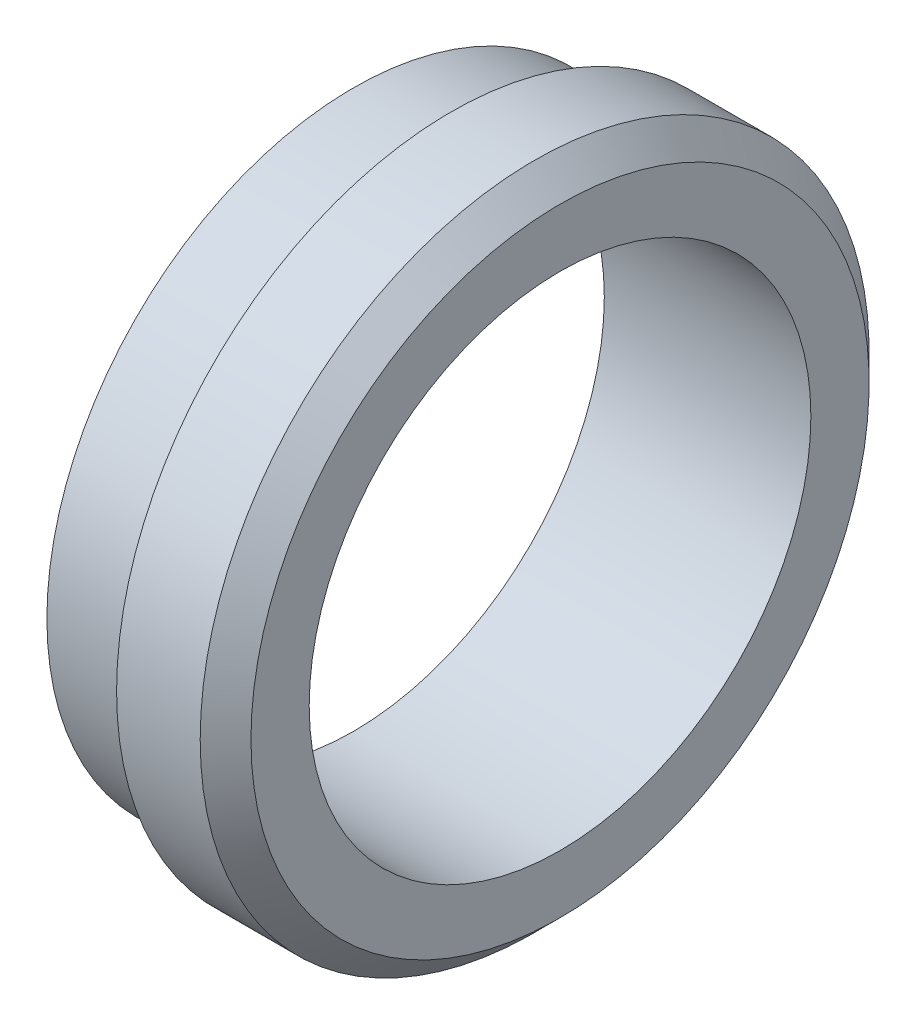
from build123d import *

# Parameters (mm, degrees)
R_P_TITION_CIRCULAIRE1_COUNT = 4


with BuildPart() as part:
    # Esquisse1 → R_volution1 (revolve)
    with BuildSketch(Plane.XY, mode=Mode.PRIVATE) as r_volution1_sk:
        Polygon((-15.782913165, 1), (-12.782913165, 1), (-12.782913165, 0.5), (-12.282913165, 0.5), (-12.282913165, 2), (-9.282913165, 2), (-8.372252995, 1.08933983), (-8.372252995, -1), (-15.782913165, -1), align=None)
    revolve(r_volution1_sk.sketch.rotate(Axis((-26.21802391, -10, 0), (1, 0, 0)), 90), axis=Axis((-26.21802391, -10, 0), (1, 0, 0)))

    # Esquisse5 → Diam_tre du per_age M1.5 _1.500000_1 (revolve, cut)
    with BuildSketch(Plane(origin=(-15.782913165, -11.005756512, -10), x_dir=(0, 0, 1), z_dir=(0, 1, 0))):
        Polygon((0, 0), (0, 2.950645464), (0.75, 2.5), (0.75, 0), align=None)
    diam_tre_du_per_age_m1_5_1_500000_1 = revolve(axis=Axis((-22.132913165, -11.005756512, -10), (1, 0, 0)), mode=Mode.SUBTRACT)

    # R_p_tition circulaire1: Diam_tre du per_age M1.5 _1.500000_1 ×4 about axis
    r_p_tition_circulaire1_axis = Axis((0, -10, 0), (1, 0, 0))
    for i in range(1, R_P_TITION_CIRCULAIRE1_COUNT):
        add(diam_tre_du_per_age_m1_5_1_500000_1.rotate(r_p_tition_circulaire1_axis, i * 360 / R_P_TITION_CIRCULAIRE1_COUNT), mode=Mode.SUBTRACT)


solid = part.part
